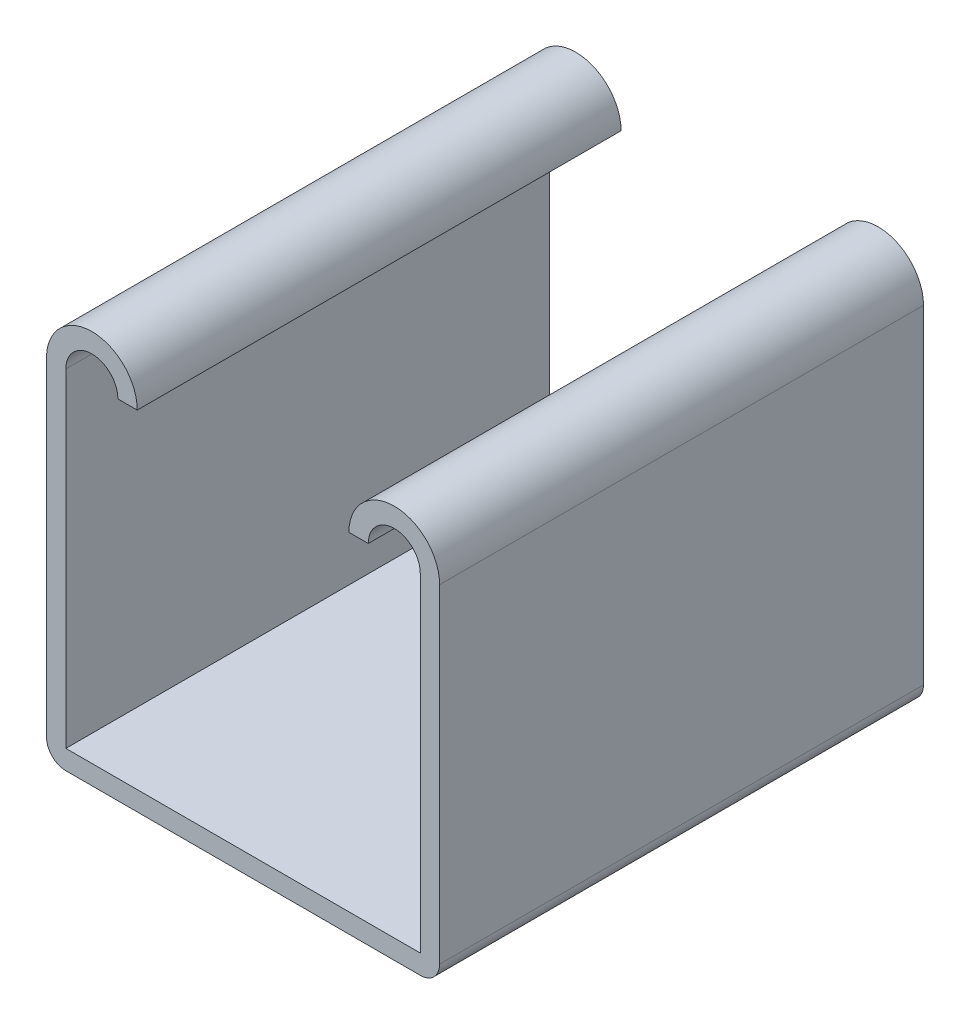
from build123d import *

# Parameters (mm, degrees)
BASE_EXTRUDE_DEPTH = 12.7


with BuildPart() as part:
    # Sketch1 → Base-Extrude (new, symmetric)
    with BuildSketch(Plane.XY):
        with BuildLine():
            Line((-10.31875, 9.37895), (-10.31875, -7.874))
            ThreePointArc((-10.31875, -7.874), (-10.02117049, -8.59242049), (-9.30275, -8.89))
            Line((-9.30275, -8.89), (9.30275, -8.89))
            ThreePointArc((9.30275, -8.89), (10.02117049, -8.59242049), (10.31875, -7.874))
            Line((10.31875, -7.874), (10.31875, 9.37895))
            ThreePointArc((10.31875, 9.37895), (7.9375, 11.7602), (5.55625, 9.37895))
            Line((5.55625, 9.37895), (6.57225, 9.37895))
            ThreePointArc((6.57225, 9.37895), (7.9375, 10.7442), (9.30275, 9.37895))
            Line((9.30275, 9.37895), (9.30275, -7.874))
            Line((9.30275, -7.874), (-9.30275, -7.874))
            Line((-9.30275, -7.874), (-9.30275, 9.37895))
            ThreePointArc((-9.30275, 9.37895), (-7.9375, 10.7442), (-6.57225, 9.37895))
            Line((-6.57225, 9.37895), (-5.55625, 9.37895))
            ThreePointArc((-5.55625, 9.37895), (-7.9375, 11.7602), (-10.31875, 9.37895))
        make_face()
    extrude(amount=BASE_EXTRUDE_DEPTH, both=True)


solid = part.part
